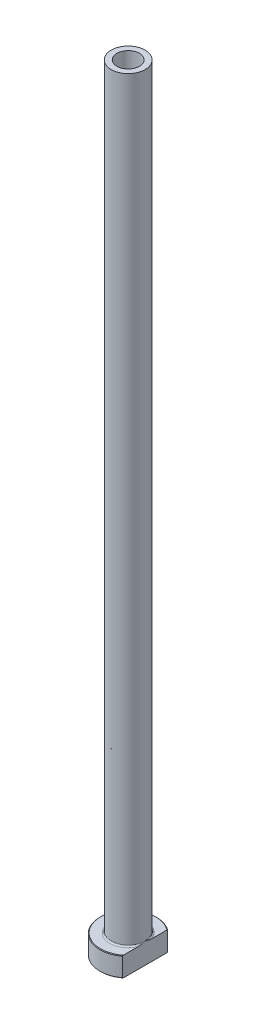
from build123d import *

# Parameters (mm, degrees)
FILLET1_R          = 0.5
CHAMFER1_SIZE      = 0.2
CUT_EXTRUDE1_DEPTH = 276.36339626
CHAMFER2_SIZE      = 0.5


with BuildPart() as part:
    # Sketch1 → Revolve1 (revolve)
    with BuildSketch(Plane.XY, mode=Mode.PRIVATE) as revolve1_sk:
        Polygon((-4, 275), (-6, 275), (-6, 7), (-10, 7), (-10, 0), (-4.25, 0), (-4.25, 218), (-4, 230), align=None)
    revolve(revolve1_sk.sketch.rotate(Axis((0, 92.187680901, 0), (0, -1, 0)), 270), axis=Axis((0, 92.187680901, 0), (0, -1, 0)))

    # Fillet1
    fillet1_edges = [part.edges().sort_by_distance(p)[0] for p in [
        (0, 7, -6),
    ]]
    fillet(fillet1_edges, radius=FILLET1_R)

    # Chamfer1
    chamfer1_edges = [part.edges().sort_by_distance(p)[0] for p in [
        (0, 0, -10),
        (0, 7, -10),
    ]]
    chamfer(chamfer1_edges, length=CHAMFER1_SIZE)

    # Sketch2 → Cut-Extrude1 (cut, through all)
    with BuildSketch(Plane.XZ):
        with BuildLine():
            Line((6, 8), (6, -8))
            ThreePointArc((6, -8), (10, 0), (6, 8))
        make_face()
    extrude(amount=-CUT_EXTRUDE1_DEPTH, mode=Mode.SUBTRACT)

    # Chamfer2
    chamfer2_edges = [part.edges().sort_by_distance(p)[0] for p in [
        (0, 0, -4.25),
    ]]
    chamfer(chamfer2_edges, length=CHAMFER2_SIZE)


solid = part.part
